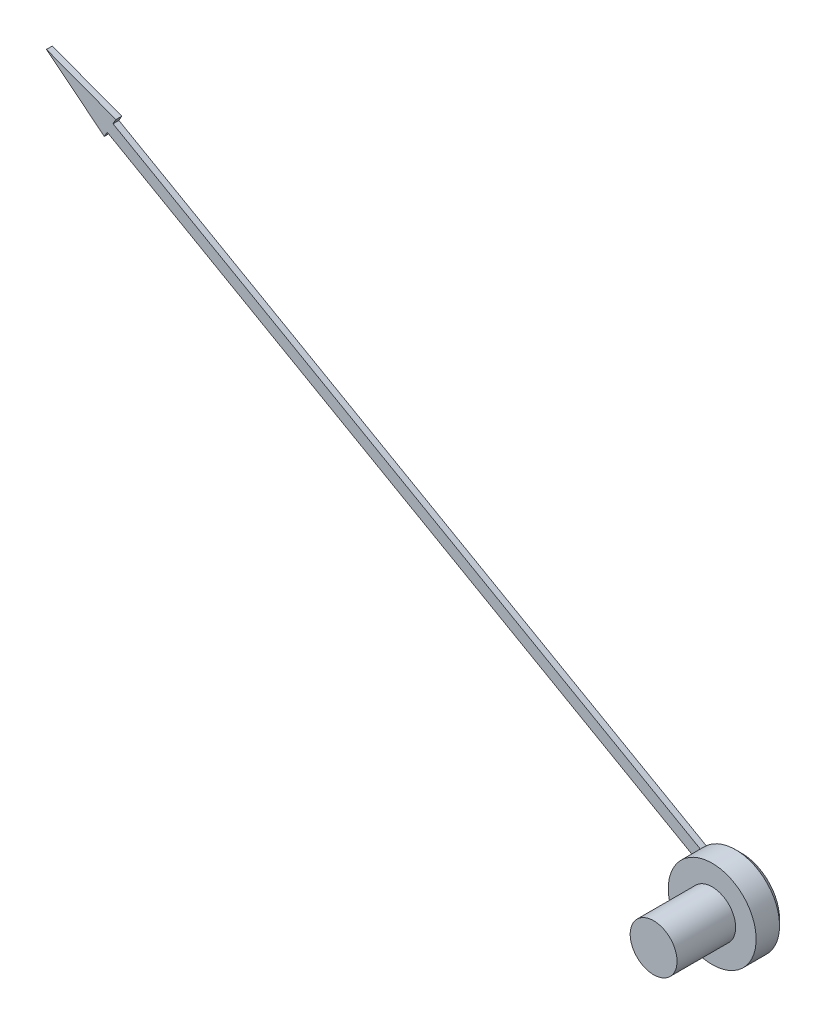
from build123d import *

# Parameters (mm, degrees)
ESQUISSE1_R          = 8
BASE_EXTRUSION_DEPTH = 20
ESQUISSE2_R          = 15
BOSS_EXTRU_1_DEPTH   = 10
CHANFREIN1_SIZE      = 2
BOSS_EXTRU_2_DEPTH   = 2


with BuildPart() as part:
    # Esquisse1 → Base-Extrusion (new body)
    with BuildSketch(Plane.XY):
        Circle(ESQUISSE1_R)
    extrude(amount=BASE_EXTRUSION_DEPTH)

    # Esquisse2 → Boss.-Extru.1 (add)
    with BuildSketch(Plane(origin=(0, 0, 0), x_dir=(-1, 0, 0), z_dir=(0, 0, -1))):
        with Locations(Location((0, 0, 0), (0, 0, 37.31835868))):
            Circle(ESQUISSE2_R)
    extrude(amount=BOSS_EXTRU_1_DEPTH)

    # Chanfrein1
    chanfrein1_edges = [part.edges().sort_by_distance(p)[0] for p in [
        (11.929189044, -9.093648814, -10),
    ]]
    chamfer(chanfrein1_edges, length=CHANFREIN1_SIZE)

    # Esquisse5 → Boss.-Extru.2 (add)
    with BuildSketch(Plane(origin=(0, 0, -10), x_dir=(-1, 0, 0), z_dir=(0, 0, -1))):
        Polygon((0.989586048, -1.738021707), (-0.989586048, 1.738021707), (212.577517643, 123.337783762), (211.587931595, 125.075805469), (235.301579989, 133.974828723), (215.546275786, 118.123718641), (214.556689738, 119.861740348), align=None)
    extrude(amount=-BOSS_EXTRU_2_DEPTH)


solid = part.part
